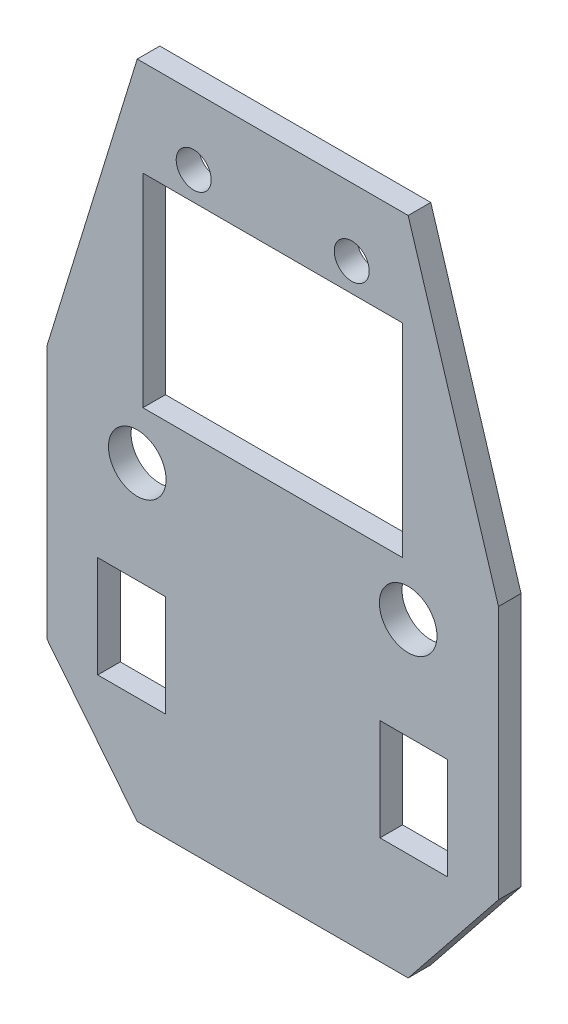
ISO-10303-21;
HEADER;
FILE_DESCRIPTION(('STEP AP214'),'2;1');
FILE_NAME('part.step','',(''),(''),'','','');
FILE_SCHEMA(('AUTOMOTIVE_DESIGN { 1 0 10303 214 1 1 1 1 }'));
ENDSEC;
DATA;
#1=APPLICATION_CONTEXT('core data for automotive mechanical design processes');
#2=APPLICATION_PROTOCOL_DEFINITION('international standard','automotive_design',2000,#1);
#3=PRODUCT_CONTEXT('',#1,'mechanical');
#4=PRODUCT('Part','Part','',(#3));
#5=PRODUCT_RELATED_PRODUCT_CATEGORY('part','',(#4));
#6=PRODUCT_DEFINITION_FORMATION('','',#4);
#7=PRODUCT_DEFINITION_CONTEXT('part definition',#1,'design');
#8=PRODUCT_DEFINITION('design','',#6,#7);
#9=PRODUCT_DEFINITION_SHAPE('','',#8);
#10=(LENGTH_UNIT() NAMED_UNIT(*) SI_UNIT(.MILLI.,.METRE.));
#11=(NAMED_UNIT(*) PLANE_ANGLE_UNIT() SI_UNIT($,.RADIAN.));
#12=(NAMED_UNIT(*) SI_UNIT($,.STERADIAN.) SOLID_ANGLE_UNIT());
#13=UNCERTAINTY_MEASURE_WITH_UNIT(LENGTH_MEASURE(1.E-05),#10,'distance_accuracy_value','');
#14=(GEOMETRIC_REPRESENTATION_CONTEXT(3) GLOBAL_UNCERTAINTY_ASSIGNED_CONTEXT((#13)) GLOBAL_UNIT_ASSIGNED_CONTEXT((#10,
#11,#12)) REPRESENTATION_CONTEXT('',''));
#15=CARTESIAN_POINT('',(0.,0.,0.));
#16=DIRECTION('',(0.,0.,1.));
#17=DIRECTION('',(1.,0.,0.));
#18=AXIS2_PLACEMENT_3D('',#15,#16,#17);
#19=CARTESIAN_POINT('',(-40.,10.,-2.));
#20=DIRECTION('',(-1.,0.,0.));
#21=DIRECTION('',(0.,0.,1.));
#22=AXIS2_PLACEMENT_3D('',#19,#20,#21);
#23=PLANE('',#22);
#24=DIRECTION('',(0.,-1.,0.));
#25=VECTOR('',#24,1.);
#26=CARTESIAN_POINT('',(-40.,10.,2.));
#27=LINE('',#26,#25);
#28=CARTESIAN_POINT('',(-40.,10.,2.));
#29=VERTEX_POINT('',#28);
#30=CARTESIAN_POINT('',(-40.,-35.,2.));
#31=VERTEX_POINT('',#30);
#32=EDGE_CURVE('E248',#29,#31,#27,.T.);
#33=ORIENTED_EDGE('',*,*,#32,.F.);
#34=DIRECTION('',(0.,0.,1.));
#35=VECTOR('',#34,1.);
#36=CARTESIAN_POINT('',(-40.,10.,-2.));
#37=LINE('',#36,#35);
#38=CARTESIAN_POINT('',(-40.,10.,-2.));
#39=VERTEX_POINT('',#38);
#40=EDGE_CURVE('E297',#39,#29,#37,.T.);
#41=ORIENTED_EDGE('',*,*,#40,.F.);
#42=DIRECTION('',(0.,-1.,0.));
#43=VECTOR('',#42,1.);
#44=CARTESIAN_POINT('',(-40.,10.,-2.));
#45=LINE('',#44,#43);
#46=CARTESIAN_POINT('',(-40.,-35.,-2.));
#47=VERTEX_POINT('',#46);
#48=EDGE_CURVE('E249',#39,#47,#45,.T.);
#49=ORIENTED_EDGE('',*,*,#48,.T.);
#50=DIRECTION('',(0.,0.,1.));
#51=VECTOR('',#50,1.);
#52=CARTESIAN_POINT('',(-40.,-35.,-2.));
#53=LINE('',#52,#51);
#54=EDGE_CURVE('E274',#47,#31,#53,.T.);
#55=ORIENTED_EDGE('',*,*,#54,.T.);
#56=EDGE_LOOP('',(#33,#41,#49,#55));
#57=FACE_BOUND('',#56,.T.);
#58=ADVANCED_FACE('F41',(#57),#23,.T.);
#59=CARTESIAN_POINT('',(-24.,62.,-2.));
#60=DIRECTION('',(-0.95577900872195,0.294085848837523,0.));
#61=DIRECTION('',(-0.294085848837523,-0.95577900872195,0.));
#62=AXIS2_PLACEMENT_3D('',#59,#60,#61);
#63=PLANE('',#62);
#64=DIRECTION('',(-0.294085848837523,-0.95577900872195,0.));
#65=VECTOR('',#64,1.);
#66=CARTESIAN_POINT('',(-24.,62.,2.));
#67=LINE('',#66,#65);
#68=CARTESIAN_POINT('',(-24.,62.,2.));
#69=VERTEX_POINT('',#68);
#70=EDGE_CURVE('E253',#69,#29,#67,.T.);
#71=ORIENTED_EDGE('',*,*,#70,.F.);
#72=DIRECTION('',(0.,0.,1.));
#73=VECTOR('',#72,1.);
#74=CARTESIAN_POINT('',(-24.,62.,-2.));
#75=LINE('',#74,#73);
#76=CARTESIAN_POINT('',(-24.,62.,-2.));
#77=VERTEX_POINT('',#76);
#78=EDGE_CURVE('E300',#77,#69,#75,.T.);
#79=ORIENTED_EDGE('',*,*,#78,.F.);
#80=DIRECTION('',(-0.294085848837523,-0.95577900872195,0.));
#81=VECTOR('',#80,1.);
#82=CARTESIAN_POINT('',(-24.,62.,-2.));
#83=LINE('',#82,#81);
#84=EDGE_CURVE('E271',#77,#39,#83,.T.);
#85=ORIENTED_EDGE('',*,*,#84,.T.);
#86=ORIENTED_EDGE('',*,*,#40,.T.);
#87=EDGE_LOOP('',(#71,#79,#85,#86));
#88=FACE_BOUND('',#87,.T.);
#89=ADVANCED_FACE('F425',(#88),#63,.T.);
#90=CARTESIAN_POINT('',(24.,62.,-2.));
#91=DIRECTION('',(0.,1.,0.));
#92=DIRECTION('',(0.,0.,1.));
#93=AXIS2_PLACEMENT_3D('',#90,#91,#92);
#94=PLANE('',#93);
#95=DIRECTION('',(-1.,0.,0.));
#96=VECTOR('',#95,1.);
#97=CARTESIAN_POINT('',(24.,62.,2.));
#98=LINE('',#97,#96);
#99=CARTESIAN_POINT('',(24.,62.,2.));
#100=VERTEX_POINT('',#99);
#101=EDGE_CURVE('E292',#100,#69,#98,.T.);
#102=ORIENTED_EDGE('',*,*,#101,.F.);
#103=DIRECTION('',(0.,0.,1.));
#104=VECTOR('',#103,1.);
#105=CARTESIAN_POINT('',(24.,62.,-2.));
#106=LINE('',#105,#104);
#107=CARTESIAN_POINT('',(24.,62.,-2.));
#108=VERTEX_POINT('',#107);
#109=EDGE_CURVE('E302',#108,#100,#106,.T.);
#110=ORIENTED_EDGE('',*,*,#109,.F.);
#111=DIRECTION('',(-1.,0.,0.));
#112=VECTOR('',#111,1.);
#113=CARTESIAN_POINT('',(24.,62.,-2.));
#114=LINE('',#113,#112);
#115=EDGE_CURVE('E268',#108,#77,#114,.T.);
#116=ORIENTED_EDGE('',*,*,#115,.T.);
#117=ORIENTED_EDGE('',*,*,#78,.T.);
#118=EDGE_LOOP('',(#102,#110,#116,#117));
#119=FACE_BOUND('',#118,.T.);
#120=ADVANCED_FACE('F429',(#119),#94,.T.);
#121=CARTESIAN_POINT('',(40.,10.,-2.));
#122=DIRECTION('',(0.95577900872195,0.294085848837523,0.));
#123=DIRECTION('',(-0.294085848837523,0.95577900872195,0.));
#124=AXIS2_PLACEMENT_3D('',#121,#122,#123);
#125=PLANE('',#124);
#126=DIRECTION('',(-0.294085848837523,0.95577900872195,0.));
#127=VECTOR('',#126,1.);
#128=CARTESIAN_POINT('',(40.,10.,2.));
#129=LINE('',#128,#127);
#130=CARTESIAN_POINT('',(40.,10.,2.));
#131=VERTEX_POINT('',#130);
#132=EDGE_CURVE('E289',#131,#100,#129,.T.);
#133=ORIENTED_EDGE('',*,*,#132,.F.);
#134=DIRECTION('',(0.,0.,1.));
#135=VECTOR('',#134,1.);
#136=CARTESIAN_POINT('',(40.,10.,-2.));
#137=LINE('',#136,#135);
#138=CARTESIAN_POINT('',(40.,10.,-2.));
#139=VERTEX_POINT('',#138);
#140=EDGE_CURVE('E304',#139,#131,#137,.T.);
#141=ORIENTED_EDGE('',*,*,#140,.F.);
#142=DIRECTION('',(-0.294085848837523,0.95577900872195,0.));
#143=VECTOR('',#142,1.);
#144=CARTESIAN_POINT('',(40.,10.,-2.));
#145=LINE('',#144,#143);
#146=EDGE_CURVE('E265',#139,#108,#145,.T.);
#147=ORIENTED_EDGE('',*,*,#146,.T.);
#148=ORIENTED_EDGE('',*,*,#109,.T.);
#149=EDGE_LOOP('',(#133,#141,#147,#148));
#150=FACE_BOUND('',#149,.T.);
#151=ADVANCED_FACE('F421',(#150),#125,.T.);
#152=CARTESIAN_POINT('',(40.,-35.,-2.));
#153=DIRECTION('',(1.,0.,0.));
#154=DIRECTION('',(0.,0.,-1.));
#155=AXIS2_PLACEMENT_3D('',#152,#153,#154);
#156=PLANE('',#155);
#157=DIRECTION('',(0.,1.,0.));
#158=VECTOR('',#157,1.);
#159=CARTESIAN_POINT('',(40.,-35.,2.));
#160=LINE('',#159,#158);
#161=CARTESIAN_POINT('',(40.,-35.,2.));
#162=VERTEX_POINT('',#161);
#163=EDGE_CURVE('E286',#162,#131,#160,.T.);
#164=ORIENTED_EDGE('',*,*,#163,.F.);
#165=DIRECTION('',(0.,0.,1.));
#166=VECTOR('',#165,1.);
#167=CARTESIAN_POINT('',(40.,-35.,-2.));
#168=LINE('',#167,#166);
#169=CARTESIAN_POINT('',(40.,-35.,-2.));
#170=VERTEX_POINT('',#169);
#171=EDGE_CURVE('E306',#170,#162,#168,.T.);
#172=ORIENTED_EDGE('',*,*,#171,.F.);
#173=DIRECTION('',(0.,1.,0.));
#174=VECTOR('',#173,1.);
#175=CARTESIAN_POINT('',(40.,-35.,-2.));
#176=LINE('',#175,#174);
#177=EDGE_CURVE('E262',#170,#139,#176,.T.);
#178=ORIENTED_EDGE('',*,*,#177,.T.);
#179=ORIENTED_EDGE('',*,*,#140,.T.);
#180=EDGE_LOOP('',(#164,#172,#178,#179));
#181=FACE_BOUND('',#180,.T.);
#182=ADVANCED_FACE('F417',(#181),#156,.T.);
#183=CARTESIAN_POINT('',(24.,-55.,-2.));
#184=DIRECTION('',(0.78086880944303,-0.624695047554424,0.));
#185=DIRECTION('',(0.624695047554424,0.78086880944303,0.));
#186=AXIS2_PLACEMENT_3D('',#183,#184,#185);
#187=PLANE('',#186);
#188=DIRECTION('',(0.624695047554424,0.78086880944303,0.));
#189=VECTOR('',#188,1.);
#190=CARTESIAN_POINT('',(24.,-55.,2.));
#191=LINE('',#190,#189);
#192=CARTESIAN_POINT('',(24.,-55.,2.));
#193=VERTEX_POINT('',#192);
#194=EDGE_CURVE('E283',#193,#162,#191,.T.);
#195=ORIENTED_EDGE('',*,*,#194,.F.);
#196=DIRECTION('',(0.,0.,1.));
#197=VECTOR('',#196,1.);
#198=CARTESIAN_POINT('',(24.,-55.,-2.));
#199=LINE('',#198,#197);
#200=CARTESIAN_POINT('',(24.,-55.,-2.));
#201=VERTEX_POINT('',#200);
#202=EDGE_CURVE('E308',#201,#193,#199,.T.);
#203=ORIENTED_EDGE('',*,*,#202,.F.);
#204=DIRECTION('',(0.624695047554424,0.78086880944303,0.));
#205=VECTOR('',#204,1.);
#206=CARTESIAN_POINT('',(24.,-55.,-2.));
#207=LINE('',#206,#205);
#208=EDGE_CURVE('E259',#201,#170,#207,.T.);
#209=ORIENTED_EDGE('',*,*,#208,.T.);
#210=ORIENTED_EDGE('',*,*,#171,.T.);
#211=EDGE_LOOP('',(#195,#203,#209,#210));
#212=FACE_BOUND('',#211,.T.);
#213=ADVANCED_FACE('F413',(#212),#187,.T.);
#214=CARTESIAN_POINT('',(-24.,-55.,-2.));
#215=DIRECTION('',(0.,-1.,0.));
#216=DIRECTION('',(0.,0.,-1.));
#217=AXIS2_PLACEMENT_3D('',#214,#215,#216);
#218=PLANE('',#217);
#219=DIRECTION('',(1.,0.,0.));
#220=VECTOR('',#219,1.);
#221=CARTESIAN_POINT('',(-24.,-55.,2.));
#222=LINE('',#221,#220);
#223=CARTESIAN_POINT('',(-24.,-55.,2.));
#224=VERTEX_POINT('',#223);
#225=EDGE_CURVE('E280',#224,#193,#222,.T.);
#226=ORIENTED_EDGE('',*,*,#225,.F.);
#227=DIRECTION('',(0.,0.,1.));
#228=VECTOR('',#227,1.);
#229=CARTESIAN_POINT('',(-24.,-55.,-2.));
#230=LINE('',#229,#228);
#231=CARTESIAN_POINT('',(-24.,-55.,-2.));
#232=VERTEX_POINT('',#231);
#233=EDGE_CURVE('E310',#232,#224,#230,.T.);
#234=ORIENTED_EDGE('',*,*,#233,.F.);
#235=DIRECTION('',(1.,0.,0.));
#236=VECTOR('',#235,1.);
#237=CARTESIAN_POINT('',(-24.,-55.,-2.));
#238=LINE('',#237,#236);
#239=EDGE_CURVE('E256',#232,#201,#238,.T.);
#240=ORIENTED_EDGE('',*,*,#239,.T.);
#241=ORIENTED_EDGE('',*,*,#202,.T.);
#242=EDGE_LOOP('',(#226,#234,#240,#241));
#243=FACE_BOUND('',#242,.T.);
#244=ADVANCED_FACE('F409',(#243),#218,.T.);
#245=CARTESIAN_POINT('',(-40.,-35.,-2.));
#246=DIRECTION('',(-0.78086880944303,-0.624695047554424,0.));
#247=DIRECTION('',(0.624695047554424,-0.78086880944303,0.));
#248=AXIS2_PLACEMENT_3D('',#245,#246,#247);
#249=PLANE('',#248);
#250=DIRECTION('',(0.624695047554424,-0.78086880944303,0.));
#251=VECTOR('',#250,1.);
#252=CARTESIAN_POINT('',(-40.,-35.,2.));
#253=LINE('',#252,#251);
#254=EDGE_CURVE('E277',#31,#224,#253,.T.);
#255=ORIENTED_EDGE('',*,*,#254,.F.);
#256=ORIENTED_EDGE('',*,*,#54,.F.);
#257=DIRECTION('',(0.624695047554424,-0.78086880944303,0.));
#258=VECTOR('',#257,1.);
#259=CARTESIAN_POINT('',(-40.,-35.,-2.));
#260=LINE('',#259,#258);
#261=EDGE_CURVE('E252',#47,#232,#260,.T.);
#262=ORIENTED_EDGE('',*,*,#261,.T.);
#263=ORIENTED_EDGE('',*,*,#233,.T.);
#264=EDGE_LOOP('',(#255,#256,#262,#263));
#265=FACE_BOUND('',#264,.T.);
#266=ADVANCED_FACE('F405',(#265),#249,.T.);
#267=CARTESIAN_POINT('',(0.,0.,-2.));
#268=DIRECTION('',(0.,0.,1.));
#269=DIRECTION('',(1.,0.,0.));
#270=AXIS2_PLACEMENT_3D('',#267,#268,#269);
#271=PLANE('',#270);
#272=DIRECTION('',(1.,0.,0.));
#273=VECTOR('',#272,1.);
#274=CARTESIAN_POINT('',(0.,9.,-2.));
#275=LINE('',#274,#273);
#276=CARTESIAN_POINT('',(-23.,9.,-2.));
#277=VERTEX_POINT('',#276);
#278=CARTESIAN_POINT('',(23.,9.,-2.));
#279=VERTEX_POINT('',#278);
#280=EDGE_CURVE('E226',#277,#279,#275,.T.);
#281=ORIENTED_EDGE('',*,*,#280,.T.);
#282=DIRECTION('',(0.,1.,0.));
#283=VECTOR('',#282,1.);
#284=CARTESIAN_POINT('',(23.,0.,-2.));
#285=LINE('',#284,#283);
#286=CARTESIAN_POINT('',(23.,45.,-2.));
#287=VERTEX_POINT('',#286);
#288=EDGE_CURVE('E229',#279,#287,#285,.T.);
#289=ORIENTED_EDGE('',*,*,#288,.T.);
#290=DIRECTION('',(-1.,0.,0.));
#291=VECTOR('',#290,1.);
#292=CARTESIAN_POINT('',(0.,45.,-2.));
#293=LINE('',#292,#291);
#294=CARTESIAN_POINT('',(-23.,45.,-2.));
#295=VERTEX_POINT('',#294);
#296=EDGE_CURVE('E220',#287,#295,#293,.T.);
#297=ORIENTED_EDGE('',*,*,#296,.T.);
#298=DIRECTION('',(0.,-1.,0.));
#299=VECTOR('',#298,1.);
#300=CARTESIAN_POINT('',(-23.,0.,-2.));
#301=LINE('',#300,#299);
#302=EDGE_CURVE('E223',#295,#277,#301,.T.);
#303=ORIENTED_EDGE('',*,*,#302,.T.);
#304=EDGE_LOOP('',(#281,#289,#297,#303));
#305=FACE_BOUND('',#304,.T.);
#306=DIRECTION('',(1.,0.,0.));
#307=VECTOR('',#306,1.);
#308=CARTESIAN_POINT('',(0.,-36.,-2.));
#309=LINE('',#308,#307);
#310=CARTESIAN_POINT('',(-31.,-36.,-2.));
#311=VERTEX_POINT('',#310);
#312=CARTESIAN_POINT('',(-19.,-36.,-2.));
#313=VERTEX_POINT('',#312);
#314=EDGE_CURVE('E214',#311,#313,#309,.T.);
#315=ORIENTED_EDGE('',*,*,#314,.T.);
#316=DIRECTION('',(0.,1.,0.));
#317=VECTOR('',#316,1.);
#318=CARTESIAN_POINT('',(-19.,0.,-2.));
#319=LINE('',#318,#317);
#320=CARTESIAN_POINT('',(-19.,-18.,-2.));
#321=VERTEX_POINT('',#320);
#322=EDGE_CURVE('E217',#313,#321,#319,.T.);
#323=ORIENTED_EDGE('',*,*,#322,.T.);
#324=DIRECTION('',(-1.,0.,0.));
#325=VECTOR('',#324,1.);
#326=CARTESIAN_POINT('',(0.,-18.,-2.));
#327=LINE('',#326,#325);
#328=CARTESIAN_POINT('',(-31.,-18.,-2.));
#329=VERTEX_POINT('',#328);
#330=EDGE_CURVE('E204',#321,#329,#327,.T.);
#331=ORIENTED_EDGE('',*,*,#330,.T.);
#332=DIRECTION('',(0.,-1.,0.));
#333=VECTOR('',#332,1.);
#334=CARTESIAN_POINT('',(-31.,0.,-2.));
#335=LINE('',#334,#333);
#336=EDGE_CURVE('E207',#329,#311,#335,.T.);
#337=ORIENTED_EDGE('',*,*,#336,.T.);
#338=EDGE_LOOP('',(#315,#323,#331,#337));
#339=FACE_BOUND('',#338,.T.);
#340=DIRECTION('',(1.,0.,0.));
#341=VECTOR('',#340,1.);
#342=CARTESIAN_POINT('',(0.,-36.,-2.));
#343=LINE('',#342,#341);
#344=CARTESIAN_POINT('',(19.,-36.,-2.));
#345=VERTEX_POINT('',#344);
#346=CARTESIAN_POINT('',(31.,-36.,-2.));
#347=VERTEX_POINT('',#346);
#348=EDGE_CURVE('E203',#345,#347,#343,.T.);
#349=ORIENTED_EDGE('',*,*,#348,.T.);
#350=DIRECTION('',(0.,1.,0.));
#351=VECTOR('',#350,1.);
#352=CARTESIAN_POINT('',(31.,0.,-2.));
#353=LINE('',#352,#351);
#354=CARTESIAN_POINT('',(31.,-18.,-2.));
#355=VERTEX_POINT('',#354);
#356=EDGE_CURVE('E193',#347,#355,#353,.T.);
#357=ORIENTED_EDGE('',*,*,#356,.T.);
#358=DIRECTION('',(-1.,0.,0.));
#359=VECTOR('',#358,1.);
#360=CARTESIAN_POINT('',(0.,-18.,-2.));
#361=LINE('',#360,#359);
#362=CARTESIAN_POINT('',(19.,-18.,-2.));
#363=VERTEX_POINT('',#362);
#364=EDGE_CURVE('E176',#355,#363,#361,.T.);
#365=ORIENTED_EDGE('',*,*,#364,.T.);
#366=DIRECTION('',(0.,-1.,0.));
#367=VECTOR('',#366,1.);
#368=CARTESIAN_POINT('',(19.,0.,-2.));
#369=LINE('',#368,#367);
#370=EDGE_CURVE('E187',#363,#345,#369,.T.);
#371=ORIENTED_EDGE('',*,*,#370,.T.);
#372=EDGE_LOOP('',(#349,#357,#365,#371));
#373=FACE_BOUND('',#372,.T.);
#374=CARTESIAN_POINT('',(-24.,0.,-2.));
#375=DIRECTION('',(0.,0.,1.));
#376=DIRECTION('',(1.,0.,0.));
#377=AXIS2_PLACEMENT_3D('',#374,#375,#376);
#378=CIRCLE('',#377,5.1);
#379=CARTESIAN_POINT('',(-18.9,0.,-2.));
#380=VERTEX_POINT('',#379);
#381=EDGE_CURVE('E245',#380,#380,#378,.T.);
#382=ORIENTED_EDGE('',*,*,#381,.T.);
#383=EDGE_LOOP('',(#382));
#384=FACE_BOUND('',#383,.T.);
#385=CARTESIAN_POINT('',(14.,50.,-2.));
#386=DIRECTION('',(0.,0.,1.));
#387=DIRECTION('',(1.,0.,0.));
#388=AXIS2_PLACEMENT_3D('',#385,#386,#387);
#389=CIRCLE('',#388,3.1);
#390=CARTESIAN_POINT('',(17.1,50.,-2.));
#391=VERTEX_POINT('',#390);
#392=EDGE_CURVE('E241',#391,#391,#389,.T.);
#393=ORIENTED_EDGE('',*,*,#392,.T.);
#394=EDGE_LOOP('',(#393));
#395=FACE_BOUND('',#394,.T.);
#396=CARTESIAN_POINT('',(-14.,50.,-2.));
#397=DIRECTION('',(0.,0.,1.));
#398=DIRECTION('',(1.,0.,0.));
#399=AXIS2_PLACEMENT_3D('',#396,#397,#398);
#400=CIRCLE('',#399,3.1);
#401=CARTESIAN_POINT('',(-10.9,50.,-2.));
#402=VERTEX_POINT('',#401);
#403=EDGE_CURVE('E237',#402,#402,#400,.T.);
#404=ORIENTED_EDGE('',*,*,#403,.T.);
#405=EDGE_LOOP('',(#404));
#406=FACE_BOUND('',#405,.T.);
#407=CARTESIAN_POINT('',(24.,0.,-2.));
#408=DIRECTION('',(0.,0.,1.));
#409=DIRECTION('',(1.,0.,0.));
#410=AXIS2_PLACEMENT_3D('',#407,#408,#409);
#411=CIRCLE('',#410,5.1);
#412=CARTESIAN_POINT('',(29.1,0.,-2.));
#413=VERTEX_POINT('',#412);
#414=EDGE_CURVE('E233',#413,#413,#411,.T.);
#415=ORIENTED_EDGE('',*,*,#414,.T.);
#416=EDGE_LOOP('',(#415));
#417=FACE_BOUND('',#416,.T.);
#418=ORIENTED_EDGE('',*,*,#48,.F.);
#419=ORIENTED_EDGE('',*,*,#84,.F.);
#420=ORIENTED_EDGE('',*,*,#115,.F.);
#421=ORIENTED_EDGE('',*,*,#146,.F.);
#422=ORIENTED_EDGE('',*,*,#177,.F.);
#423=ORIENTED_EDGE('',*,*,#208,.F.);
#424=ORIENTED_EDGE('',*,*,#239,.F.);
#425=ORIENTED_EDGE('',*,*,#261,.F.);
#426=EDGE_LOOP('',(#418,#419,#420,#421,#422,#423,#424,#425));
#427=FACE_BOUND('',#426,.T.);
#428=ADVANCED_FACE('F201',(#305,#339,#373,#384,#395,#406,#417,#427),#271,.F.);
#429=CARTESIAN_POINT('',(0.,0.,2.));
#430=DIRECTION('',(0.,0.,1.));
#431=DIRECTION('',(1.,0.,0.));
#432=AXIS2_PLACEMENT_3D('',#429,#430,#431);
#433=PLANE('',#432);
#434=DIRECTION('',(0.,1.,0.));
#435=VECTOR('',#434,1.);
#436=CARTESIAN_POINT('',(23.,0.,2.));
#437=LINE('',#436,#435);
#438=CARTESIAN_POINT('',(23.,9.,2.));
#439=VERTEX_POINT('',#438);
#440=CARTESIAN_POINT('',(23.,45.,2.));
#441=VERTEX_POINT('',#440);
#442=EDGE_CURVE('E11',#439,#441,#437,.T.);
#443=ORIENTED_EDGE('',*,*,#442,.F.);
#444=DIRECTION('',(1.,0.,0.));
#445=VECTOR('',#444,1.);
#446=CARTESIAN_POINT('',(0.,9.,2.));
#447=LINE('',#446,#445);
#448=CARTESIAN_POINT('',(-23.,9.,2.));
#449=VERTEX_POINT('',#448);
#450=EDGE_CURVE('E48',#449,#439,#447,.T.);
#451=ORIENTED_EDGE('',*,*,#450,.F.);
#452=DIRECTION('',(0.,-1.,0.));
#453=VECTOR('',#452,1.);
#454=CARTESIAN_POINT('',(-23.,0.,2.));
#455=LINE('',#454,#453);
#456=CARTESIAN_POINT('',(-23.,45.,2.));
#457=VERTEX_POINT('',#456);
#458=EDGE_CURVE('E338',#457,#449,#455,.T.);
#459=ORIENTED_EDGE('',*,*,#458,.F.);
#460=DIRECTION('',(-1.,0.,0.));
#461=VECTOR('',#460,1.);
#462=CARTESIAN_POINT('',(0.,45.,2.));
#463=LINE('',#462,#461);
#464=EDGE_CURVE('E336',#441,#457,#463,.T.);
#465=ORIENTED_EDGE('',*,*,#464,.F.);
#466=EDGE_LOOP('',(#443,#451,#459,#465));
#467=FACE_BOUND('',#466,.T.);
#468=DIRECTION('',(0.,1.,0.));
#469=VECTOR('',#468,1.);
#470=CARTESIAN_POINT('',(-19.,0.,2.));
#471=LINE('',#470,#469);
#472=CARTESIAN_POINT('',(-19.,-36.,2.));
#473=VERTEX_POINT('',#472);
#474=CARTESIAN_POINT('',(-19.,-18.,2.));
#475=VERTEX_POINT('',#474);
#476=EDGE_CURVE('E333',#473,#475,#471,.T.);
#477=ORIENTED_EDGE('',*,*,#476,.F.);
#478=DIRECTION('',(1.,0.,0.));
#479=VECTOR('',#478,1.);
#480=CARTESIAN_POINT('',(0.,-36.,2.));
#481=LINE('',#480,#479);
#482=CARTESIAN_POINT('',(-31.,-36.,2.));
#483=VERTEX_POINT('',#482);
#484=EDGE_CURVE('E331',#483,#473,#481,.T.);
#485=ORIENTED_EDGE('',*,*,#484,.F.);
#486=DIRECTION('',(0.,-1.,0.));
#487=VECTOR('',#486,1.);
#488=CARTESIAN_POINT('',(-31.,0.,2.));
#489=LINE('',#488,#487);
#490=CARTESIAN_POINT('',(-31.,-18.,2.));
#491=VERTEX_POINT('',#490);
#492=EDGE_CURVE('E329',#491,#483,#489,.T.);
#493=ORIENTED_EDGE('',*,*,#492,.F.);
#494=DIRECTION('',(-1.,0.,0.));
#495=VECTOR('',#494,1.);
#496=CARTESIAN_POINT('',(0.,-18.,2.));
#497=LINE('',#496,#495);
#498=EDGE_CURVE('E327',#475,#491,#497,.T.);
#499=ORIENTED_EDGE('',*,*,#498,.F.);
#500=EDGE_LOOP('',(#477,#485,#493,#499));
#501=FACE_BOUND('',#500,.T.);
#502=DIRECTION('',(0.,1.,0.));
#503=VECTOR('',#502,1.);
#504=CARTESIAN_POINT('',(31.,0.,2.));
#505=LINE('',#504,#503);
#506=CARTESIAN_POINT('',(31.,-36.,2.));
#507=VERTEX_POINT('',#506);
#508=CARTESIAN_POINT('',(31.,-18.,2.));
#509=VERTEX_POINT('',#508);
#510=EDGE_CURVE('E196',#507,#509,#505,.T.);
#511=ORIENTED_EDGE('',*,*,#510,.F.);
#512=DIRECTION('',(1.,0.,0.));
#513=VECTOR('',#512,1.);
#514=CARTESIAN_POINT('',(0.,-36.,2.));
#515=LINE('',#514,#513);
#516=CARTESIAN_POINT('',(19.,-36.,2.));
#517=VERTEX_POINT('',#516);
#518=EDGE_CURVE('E324',#517,#507,#515,.T.);
#519=ORIENTED_EDGE('',*,*,#518,.F.);
#520=DIRECTION('',(0.,-1.,0.));
#521=VECTOR('',#520,1.);
#522=CARTESIAN_POINT('',(19.,0.,2.));
#523=LINE('',#522,#521);
#524=CARTESIAN_POINT('',(19.,-18.,2.));
#525=VERTEX_POINT('',#524);
#526=EDGE_CURVE('E322',#525,#517,#523,.T.);
#527=ORIENTED_EDGE('',*,*,#526,.F.);
#528=DIRECTION('',(-1.,0.,0.));
#529=VECTOR('',#528,1.);
#530=CARTESIAN_POINT('',(0.,-18.,2.));
#531=LINE('',#530,#529);
#532=EDGE_CURVE('E299',#509,#525,#531,.T.);
#533=ORIENTED_EDGE('',*,*,#532,.F.);
#534=EDGE_LOOP('',(#511,#519,#527,#533));
#535=FACE_BOUND('',#534,.T.);
#536=CARTESIAN_POINT('',(-24.,0.,2.));
#537=DIRECTION('',(0.,0.,1.));
#538=DIRECTION('',(1.,0.,0.));
#539=AXIS2_PLACEMENT_3D('',#536,#537,#538);
#540=CIRCLE('',#539,5.1);
#541=CARTESIAN_POINT('',(-18.9,0.,2.));
#542=VERTEX_POINT('',#541);
#543=EDGE_CURVE('E244',#542,#542,#540,.T.);
#544=ORIENTED_EDGE('',*,*,#543,.F.);
#545=EDGE_LOOP('',(#544));
#546=FACE_BOUND('',#545,.T.);
#547=CARTESIAN_POINT('',(14.,50.,2.));
#548=DIRECTION('',(0.,0.,1.));
#549=DIRECTION('',(1.,0.,0.));
#550=AXIS2_PLACEMENT_3D('',#547,#548,#549);
#551=CIRCLE('',#550,3.1);
#552=CARTESIAN_POINT('',(17.1,50.,2.));
#553=VERTEX_POINT('',#552);
#554=EDGE_CURVE('E240',#553,#553,#551,.T.);
#555=ORIENTED_EDGE('',*,*,#554,.F.);
#556=EDGE_LOOP('',(#555));
#557=FACE_BOUND('',#556,.T.);
#558=CARTESIAN_POINT('',(-14.,50.,2.));
#559=DIRECTION('',(0.,0.,1.));
#560=DIRECTION('',(1.,0.,0.));
#561=AXIS2_PLACEMENT_3D('',#558,#559,#560);
#562=CIRCLE('',#561,3.1);
#563=CARTESIAN_POINT('',(-10.9,50.,2.));
#564=VERTEX_POINT('',#563);
#565=EDGE_CURVE('E236',#564,#564,#562,.T.);
#566=ORIENTED_EDGE('',*,*,#565,.F.);
#567=EDGE_LOOP('',(#566));
#568=FACE_BOUND('',#567,.T.);
#569=CARTESIAN_POINT('',(24.,0.,2.));
#570=DIRECTION('',(0.,0.,1.));
#571=DIRECTION('',(1.,0.,0.));
#572=AXIS2_PLACEMENT_3D('',#569,#570,#571);
#573=CIRCLE('',#572,5.1);
#574=CARTESIAN_POINT('',(29.1,0.,2.));
#575=VERTEX_POINT('',#574);
#576=EDGE_CURVE('E232',#575,#575,#573,.T.);
#577=ORIENTED_EDGE('',*,*,#576,.F.);
#578=EDGE_LOOP('',(#577));
#579=FACE_BOUND('',#578,.T.);
#580=ORIENTED_EDGE('',*,*,#32,.T.);
#581=ORIENTED_EDGE('',*,*,#254,.T.);
#582=ORIENTED_EDGE('',*,*,#225,.T.);
#583=ORIENTED_EDGE('',*,*,#194,.T.);
#584=ORIENTED_EDGE('',*,*,#163,.T.);
#585=ORIENTED_EDGE('',*,*,#132,.T.);
#586=ORIENTED_EDGE('',*,*,#101,.T.);
#587=ORIENTED_EDGE('',*,*,#70,.T.);
#588=EDGE_LOOP('',(#580,#581,#582,#583,#584,#585,#586,#587));
#589=FACE_BOUND('',#588,.T.);
#590=ADVANCED_FACE('F355',(#467,#501,#535,#546,#557,#568,#579,#589),#433,.T.);
#591=CARTESIAN_POINT('',(24.,0.,-250.));
#592=DIRECTION('',(0.,0.,1.));
#593=DIRECTION('',(1.,0.,0.));
#594=AXIS2_PLACEMENT_3D('',#591,#592,#593);
#595=CYLINDRICAL_SURFACE('',#594,5.1);
#596=ORIENTED_EDGE('',*,*,#576,.T.);
#597=EDGE_LOOP('',(#596));
#598=FACE_BOUND('',#597,.T.);
#599=ORIENTED_EDGE('',*,*,#414,.F.);
#600=EDGE_LOOP('',(#599));
#601=FACE_BOUND('',#600,.T.);
#602=ADVANCED_FACE('F388',(#598,#601),#595,.F.);
#603=CARTESIAN_POINT('',(-14.,50.,-250.));
#604=DIRECTION('',(0.,0.,1.));
#605=DIRECTION('',(1.,0.,0.));
#606=AXIS2_PLACEMENT_3D('',#603,#604,#605);
#607=CYLINDRICAL_SURFACE('',#606,3.1);
#608=ORIENTED_EDGE('',*,*,#565,.T.);
#609=EDGE_LOOP('',(#608));
#610=FACE_BOUND('',#609,.T.);
#611=ORIENTED_EDGE('',*,*,#403,.F.);
#612=EDGE_LOOP('',(#611));
#613=FACE_BOUND('',#612,.T.);
#614=ADVANCED_FACE('F514',(#610,#613),#607,.F.);
#615=CARTESIAN_POINT('',(14.,50.,-250.));
#616=DIRECTION('',(0.,0.,1.));
#617=DIRECTION('',(1.,0.,0.));
#618=AXIS2_PLACEMENT_3D('',#615,#616,#617);
#619=CYLINDRICAL_SURFACE('',#618,3.1);
#620=ORIENTED_EDGE('',*,*,#554,.T.);
#621=EDGE_LOOP('',(#620));
#622=FACE_BOUND('',#621,.T.);
#623=ORIENTED_EDGE('',*,*,#392,.F.);
#624=EDGE_LOOP('',(#623));
#625=FACE_BOUND('',#624,.T.);
#626=ADVANCED_FACE('F524',(#622,#625),#619,.F.);
#627=CARTESIAN_POINT('',(-24.,0.,-250.));
#628=DIRECTION('',(0.,0.,1.));
#629=DIRECTION('',(1.,0.,0.));
#630=AXIS2_PLACEMENT_3D('',#627,#628,#629);
#631=CYLINDRICAL_SURFACE('',#630,5.1);
#632=ORIENTED_EDGE('',*,*,#543,.T.);
#633=EDGE_LOOP('',(#632));
#634=FACE_BOUND('',#633,.T.);
#635=ORIENTED_EDGE('',*,*,#381,.F.);
#636=EDGE_LOOP('',(#635));
#637=FACE_BOUND('',#636,.T.);
#638=ADVANCED_FACE('F534',(#634,#637),#631,.F.);
#639=CARTESIAN_POINT('',(31.,-36.,-250.));
#640=DIRECTION('',(1.,0.,0.));
#641=DIRECTION('',(0.,0.,-1.));
#642=AXIS2_PLACEMENT_3D('',#639,#640,#641);
#643=PLANE('',#642);
#644=DIRECTION('',(0.,0.,1.));
#645=VECTOR('',#644,1.);
#646=CARTESIAN_POINT('',(31.,-36.,-250.));
#647=LINE('',#646,#645);
#648=EDGE_CURVE('E377',#347,#507,#647,.T.);
#649=ORIENTED_EDGE('',*,*,#648,.T.);
#650=ORIENTED_EDGE('',*,*,#510,.T.);
#651=DIRECTION('',(0.,0.,1.));
#652=VECTOR('',#651,1.);
#653=CARTESIAN_POINT('',(31.,-18.,-250.));
#654=LINE('',#653,#652);
#655=EDGE_CURVE('E179',#355,#509,#654,.T.);
#656=ORIENTED_EDGE('',*,*,#655,.F.);
#657=ORIENTED_EDGE('',*,*,#356,.F.);
#658=EDGE_LOOP('',(#649,#650,#656,#657));
#659=FACE_BOUND('',#658,.T.);
#660=ADVANCED_FACE('F192',(#659),#643,.F.);
#661=CARTESIAN_POINT('',(19.,-36.,-250.));
#662=DIRECTION('',(0.,-1.,0.));
#663=DIRECTION('',(0.,0.,-1.));
#664=AXIS2_PLACEMENT_3D('',#661,#662,#663);
#665=PLANE('',#664);
#666=DIRECTION('',(0.,0.,1.));
#667=VECTOR('',#666,1.);
#668=CARTESIAN_POINT('',(19.,-36.,-250.));
#669=LINE('',#668,#667);
#670=EDGE_CURVE('E374',#345,#517,#669,.T.);
#671=ORIENTED_EDGE('',*,*,#670,.T.);
#672=ORIENTED_EDGE('',*,*,#518,.T.);
#673=ORIENTED_EDGE('',*,*,#648,.F.);
#674=ORIENTED_EDGE('',*,*,#348,.F.);
#675=EDGE_LOOP('',(#671,#672,#673,#674));
#676=FACE_BOUND('',#675,.T.);
#677=ADVANCED_FACE('F384',(#676),#665,.F.);
#678=CARTESIAN_POINT('',(19.,-36.,-250.));
#679=DIRECTION('',(-1.,0.,0.));
#680=DIRECTION('',(0.,0.,1.));
#681=AXIS2_PLACEMENT_3D('',#678,#679,#680);
#682=PLANE('',#681);
#683=DIRECTION('',(0.,0.,1.));
#684=VECTOR('',#683,1.);
#685=CARTESIAN_POINT('',(19.,-18.,-250.));
#686=LINE('',#685,#684);
#687=EDGE_CURVE('E182',#363,#525,#686,.T.);
#688=ORIENTED_EDGE('',*,*,#687,.T.);
#689=ORIENTED_EDGE('',*,*,#526,.T.);
#690=ORIENTED_EDGE('',*,*,#670,.F.);
#691=ORIENTED_EDGE('',*,*,#370,.F.);
#692=EDGE_LOOP('',(#688,#689,#690,#691));
#693=FACE_BOUND('',#692,.T.);
#694=ADVANCED_FACE('F380',(#693),#682,.F.);
#695=CARTESIAN_POINT('',(19.,-18.,-250.));
#696=DIRECTION('',(0.,1.,0.));
#697=DIRECTION('',(0.,0.,1.));
#698=AXIS2_PLACEMENT_3D('',#695,#696,#697);
#699=PLANE('',#698);
#700=ORIENTED_EDGE('',*,*,#655,.T.);
#701=ORIENTED_EDGE('',*,*,#532,.T.);
#702=ORIENTED_EDGE('',*,*,#687,.F.);
#703=ORIENTED_EDGE('',*,*,#364,.F.);
#704=EDGE_LOOP('',(#700,#701,#702,#703));
#705=FACE_BOUND('',#704,.T.);
#706=ADVANCED_FACE('F178',(#705),#699,.F.);
#707=CARTESIAN_POINT('',(-19.,-36.,-250.));
#708=DIRECTION('',(1.,0.,0.));
#709=DIRECTION('',(0.,0.,-1.));
#710=AXIS2_PLACEMENT_3D('',#707,#708,#709);
#711=PLANE('',#710);
#712=DIRECTION('',(0.,0.,1.));
#713=VECTOR('',#712,1.);
#714=CARTESIAN_POINT('',(-19.,-36.,-250.));
#715=LINE('',#714,#713);
#716=EDGE_CURVE('E198',#313,#473,#715,.T.);
#717=ORIENTED_EDGE('',*,*,#716,.T.);
#718=ORIENTED_EDGE('',*,*,#476,.T.);
#719=DIRECTION('',(0.,0.,1.));
#720=VECTOR('',#719,1.);
#721=CARTESIAN_POINT('',(-19.,-18.,-250.));
#722=LINE('',#721,#720);
#723=EDGE_CURVE('E363',#321,#475,#722,.T.);
#724=ORIENTED_EDGE('',*,*,#723,.F.);
#725=ORIENTED_EDGE('',*,*,#322,.F.);
#726=EDGE_LOOP('',(#717,#718,#724,#725));
#727=FACE_BOUND('',#726,.T.);
#728=ADVANCED_FACE('F575',(#727),#711,.F.);
#729=CARTESIAN_POINT('',(-31.,-36.,-250.));
#730=DIRECTION('',(0.,-1.,0.));
#731=DIRECTION('',(0.,0.,-1.));
#732=AXIS2_PLACEMENT_3D('',#729,#730,#731);
#733=PLANE('',#732);
#734=DIRECTION('',(0.,0.,1.));
#735=VECTOR('',#734,1.);
#736=CARTESIAN_POINT('',(-31.,-36.,-250.));
#737=LINE('',#736,#735);
#738=EDGE_CURVE('E368',#311,#483,#737,.T.);
#739=ORIENTED_EDGE('',*,*,#738,.T.);
#740=ORIENTED_EDGE('',*,*,#484,.T.);
#741=ORIENTED_EDGE('',*,*,#716,.F.);
#742=ORIENTED_EDGE('',*,*,#314,.F.);
#743=EDGE_LOOP('',(#739,#740,#741,#742));
#744=FACE_BOUND('',#743,.T.);
#745=ADVANCED_FACE('F584',(#744),#733,.F.);
#746=CARTESIAN_POINT('',(-31.,-36.,-250.));
#747=DIRECTION('',(-1.,0.,0.));
#748=DIRECTION('',(0.,0.,1.));
#749=AXIS2_PLACEMENT_3D('',#746,#747,#748);
#750=PLANE('',#749);
#751=DIRECTION('',(0.,0.,1.));
#752=VECTOR('',#751,1.);
#753=CARTESIAN_POINT('',(-31.,-18.,-250.));
#754=LINE('',#753,#752);
#755=EDGE_CURVE('E63',#329,#491,#754,.T.);
#756=ORIENTED_EDGE('',*,*,#755,.T.);
#757=ORIENTED_EDGE('',*,*,#492,.T.);
#758=ORIENTED_EDGE('',*,*,#738,.F.);
#759=ORIENTED_EDGE('',*,*,#336,.F.);
#760=EDGE_LOOP('',(#756,#757,#758,#759));
#761=FACE_BOUND('',#760,.T.);
#762=ADVANCED_FACE('F594',(#761),#750,.F.);
#763=CARTESIAN_POINT('',(-31.,-18.,-250.));
#764=DIRECTION('',(0.,1.,0.));
#765=DIRECTION('',(0.,0.,1.));
#766=AXIS2_PLACEMENT_3D('',#763,#764,#765);
#767=PLANE('',#766);
#768=ORIENTED_EDGE('',*,*,#723,.T.);
#769=ORIENTED_EDGE('',*,*,#498,.T.);
#770=ORIENTED_EDGE('',*,*,#755,.F.);
#771=ORIENTED_EDGE('',*,*,#330,.F.);
#772=EDGE_LOOP('',(#768,#769,#770,#771));
#773=FACE_BOUND('',#772,.T.);
#774=ADVANCED_FACE('F604',(#773),#767,.F.);
#775=CARTESIAN_POINT('',(23.,9.,-250.));
#776=DIRECTION('',(1.,0.,0.));
#777=DIRECTION('',(0.,0.,-1.));
#778=AXIS2_PLACEMENT_3D('',#775,#776,#777);
#779=PLANE('',#778);
#780=DIRECTION('',(0.,0.,1.));
#781=VECTOR('',#780,1.);
#782=CARTESIAN_POINT('',(23.,9.,-250.));
#783=LINE('',#782,#781);
#784=EDGE_CURVE('E188',#279,#439,#783,.T.);
#785=ORIENTED_EDGE('',*,*,#784,.T.);
#786=ORIENTED_EDGE('',*,*,#442,.T.);
#787=DIRECTION('',(0.,0.,1.));
#788=VECTOR('',#787,1.);
#789=CARTESIAN_POINT('',(23.,45.,-250.));
#790=LINE('',#789,#788);
#791=EDGE_CURVE('E358',#287,#441,#790,.T.);
#792=ORIENTED_EDGE('',*,*,#791,.F.);
#793=ORIENTED_EDGE('',*,*,#288,.F.);
#794=EDGE_LOOP('',(#785,#786,#792,#793));
#795=FACE_BOUND('',#794,.T.);
#796=ADVANCED_FACE('F351',(#795),#779,.F.);
#797=CARTESIAN_POINT('',(-23.,9.,-250.));
#798=DIRECTION('',(0.,-1.,0.));
#799=DIRECTION('',(0.,0.,-1.));
#800=AXIS2_PLACEMENT_3D('',#797,#798,#799);
#801=PLANE('',#800);
#802=DIRECTION('',(0.,0.,1.));
#803=VECTOR('',#802,1.);
#804=CARTESIAN_POINT('',(-23.,9.,-250.));
#805=LINE('',#804,#803);
#806=EDGE_CURVE('E346',#277,#449,#805,.T.);
#807=ORIENTED_EDGE('',*,*,#806,.T.);
#808=ORIENTED_EDGE('',*,*,#450,.T.);
#809=ORIENTED_EDGE('',*,*,#784,.F.);
#810=ORIENTED_EDGE('',*,*,#280,.F.);
#811=EDGE_LOOP('',(#807,#808,#809,#810));
#812=FACE_BOUND('',#811,.T.);
#813=ADVANCED_FACE('F344',(#812),#801,.F.);
#814=CARTESIAN_POINT('',(-23.,9.,-250.));
#815=DIRECTION('',(-1.,0.,0.));
#816=DIRECTION('',(0.,0.,1.));
#817=AXIS2_PLACEMENT_3D('',#814,#815,#816);
#818=PLANE('',#817);
#819=DIRECTION('',(0.,0.,1.));
#820=VECTOR('',#819,1.);
#821=CARTESIAN_POINT('',(-23.,45.,-250.));
#822=LINE('',#821,#820);
#823=EDGE_CURVE('E55',#295,#457,#822,.T.);
#824=ORIENTED_EDGE('',*,*,#823,.T.);
#825=ORIENTED_EDGE('',*,*,#458,.T.);
#826=ORIENTED_EDGE('',*,*,#806,.F.);
#827=ORIENTED_EDGE('',*,*,#302,.F.);
#828=EDGE_LOOP('',(#824,#825,#826,#827));
#829=FACE_BOUND('',#828,.T.);
#830=ADVANCED_FACE('F360',(#829),#818,.F.);
#831=CARTESIAN_POINT('',(-23.,45.,-250.));
#832=DIRECTION('',(0.,1.,0.));
#833=DIRECTION('',(0.,0.,1.));
#834=AXIS2_PLACEMENT_3D('',#831,#832,#833);
#835=PLANE('',#834);
#836=ORIENTED_EDGE('',*,*,#791,.T.);
#837=ORIENTED_EDGE('',*,*,#464,.T.);
#838=ORIENTED_EDGE('',*,*,#823,.F.);
#839=ORIENTED_EDGE('',*,*,#296,.F.);
#840=EDGE_LOOP('',(#836,#837,#838,#839));
#841=FACE_BOUND('',#840,.T.);
#842=ADVANCED_FACE('F357',(#841),#835,.F.);
#843=CLOSED_SHELL('',(#58,#89,#120,#151,#182,#213,#244,#266,#428,#590,#602,#614,#626,#638,#660,
#677,#694,#706,#728,#745,#762,#774,#796,#813,#830,#842));
#844=MANIFOLD_SOLID_BREP('B2',#843);
#845=ADVANCED_BREP_SHAPE_REPRESENTATION('',(#18,#844),#14);
#846=SHAPE_DEFINITION_REPRESENTATION(#9,#845);
ENDSEC;
END-ISO-10303-21;
